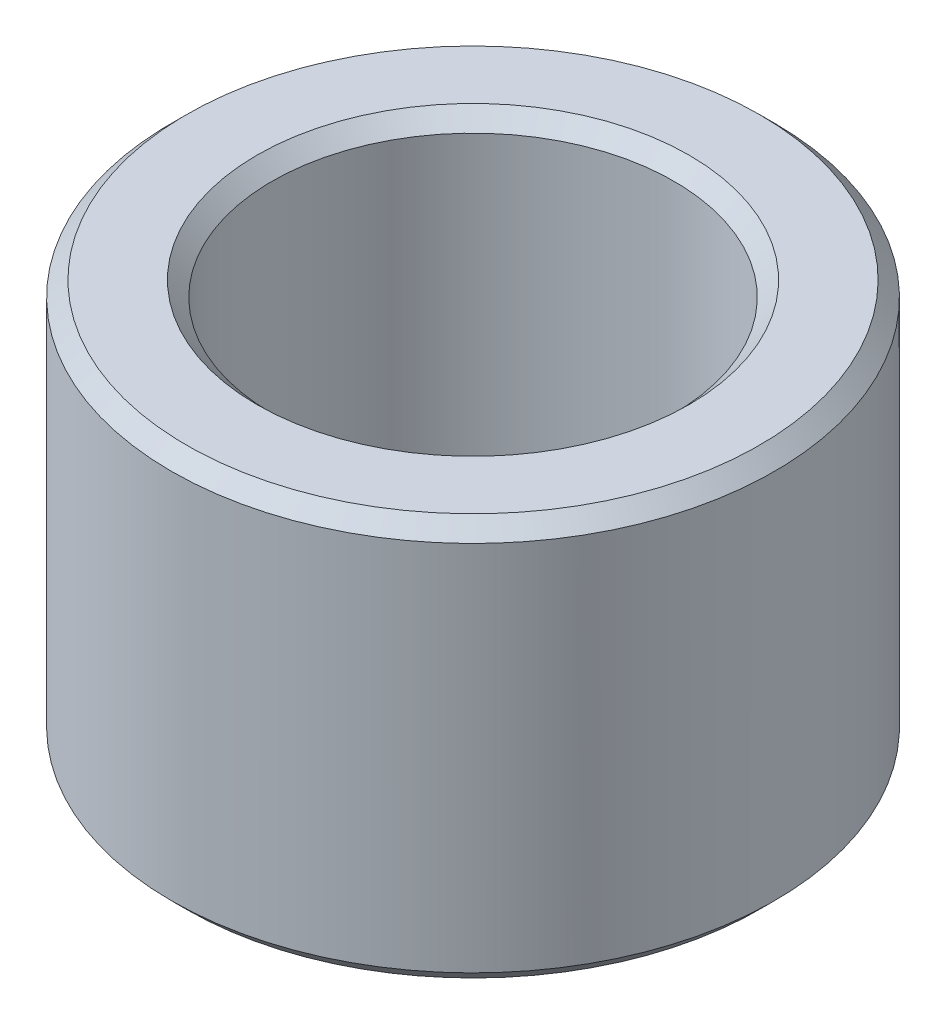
ISO-10303-21;
HEADER;
FILE_DESCRIPTION(('STEP AP214'),'2;1');
FILE_NAME('part.step','',(''),(''),'','','');
FILE_SCHEMA(('AUTOMOTIVE_DESIGN { 1 0 10303 214 1 1 1 1 }'));
ENDSEC;
DATA;
#1=APPLICATION_CONTEXT('core data for automotive mechanical design processes');
#2=APPLICATION_PROTOCOL_DEFINITION('international standard','automotive_design',2000,#1);
#3=PRODUCT_CONTEXT('',#1,'mechanical');
#4=PRODUCT('Part','Part','',(#3));
#5=PRODUCT_RELATED_PRODUCT_CATEGORY('part','',(#4));
#6=PRODUCT_DEFINITION_FORMATION('','',#4);
#7=PRODUCT_DEFINITION_CONTEXT('part definition',#1,'design');
#8=PRODUCT_DEFINITION('design','',#6,#7);
#9=PRODUCT_DEFINITION_SHAPE('','',#8);
#10=(LENGTH_UNIT() NAMED_UNIT(*) SI_UNIT(.MILLI.,.METRE.));
#11=(NAMED_UNIT(*) PLANE_ANGLE_UNIT() SI_UNIT($,.RADIAN.));
#12=(NAMED_UNIT(*) SI_UNIT($,.STERADIAN.) SOLID_ANGLE_UNIT());
#13=UNCERTAINTY_MEASURE_WITH_UNIT(LENGTH_MEASURE(1.E-05),#10,'distance_accuracy_value','');
#14=(GEOMETRIC_REPRESENTATION_CONTEXT(3) GLOBAL_UNCERTAINTY_ASSIGNED_CONTEXT((#13)) GLOBAL_UNIT_ASSIGNED_CONTEXT((#10,
#11,#12)) REPRESENTATION_CONTEXT('',''));
#15=CARTESIAN_POINT('',(0.,0.,0.));
#16=DIRECTION('',(0.,0.,1.));
#17=DIRECTION('',(1.,0.,0.));
#18=AXIS2_PLACEMENT_3D('',#15,#16,#17);
#19=CARTESIAN_POINT('',(6.00000000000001,8.,0.));
#20=DIRECTION('',(0.,-1.,0.));
#21=DIRECTION('',(0.,0.,-1.));
#22=AXIS2_PLACEMENT_3D('',#19,#20,#21);
#23=PLANE('',#22);
#24=CARTESIAN_POINT('',(0.,8.,0.));
#25=DIRECTION('',(0.,-1.,0.));
#26=DIRECTION('',(0.,0.,-1.));
#27=AXIS2_PLACEMENT_3D('',#24,#25,#26);
#28=CIRCLE('',#27,4.30000000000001);
#29=CARTESIAN_POINT('',(0.,8.,4.30000000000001));
#30=VERTEX_POINT('',#29);
#31=EDGE_CURVE('E46',#30,#30,#28,.T.);
#32=ORIENTED_EDGE('',*,*,#31,.T.);
#33=EDGE_LOOP('',(#32));
#34=FACE_BOUND('',#33,.T.);
#35=CARTESIAN_POINT('',(0.,8.,0.));
#36=DIRECTION('',(0.,-1.,0.));
#37=DIRECTION('',(0.,0.,-1.));
#38=AXIS2_PLACEMENT_3D('',#35,#36,#37);
#39=CIRCLE('',#38,5.7);
#40=CARTESIAN_POINT('',(0.,8.,-5.7));
#41=VERTEX_POINT('',#40);
#42=EDGE_CURVE('E49',#41,#41,#39,.F.);
#43=ORIENTED_EDGE('',*,*,#42,.T.);
#44=EDGE_LOOP('',(#43));
#45=FACE_BOUND('',#44,.T.);
#46=ADVANCED_FACE('F27',(#34,#45),#23,.F.);
#47=CARTESIAN_POINT('',(0.,30.,0.));
#48=DIRECTION('',(0.,1.,0.));
#49=DIRECTION('',(0.,0.,1.));
#50=AXIS2_PLACEMENT_3D('',#47,#48,#49);
#51=CYLINDRICAL_SURFACE('',#50,4.00000000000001);
#52=CARTESIAN_POINT('',(0.,7.69999999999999,0.));
#53=DIRECTION('',(0.,-1.,0.));
#54=DIRECTION('',(0.,0.,-1.));
#55=AXIS2_PLACEMENT_3D('',#52,#53,#54);
#56=CIRCLE('',#55,4.00000000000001);
#57=CARTESIAN_POINT('',(0.,7.7,4.00000000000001));
#58=VERTEX_POINT('',#57);
#59=EDGE_CURVE('E52',#58,#58,#56,.F.);
#60=CARTESIAN_POINT('',(0.,0.300000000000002,0.));
#61=DIRECTION('',(0.,1.,0.));
#62=DIRECTION('',(0.,0.,1.));
#63=AXIS2_PLACEMENT_3D('',#60,#61,#62);
#64=CIRCLE('',#63,4.00000000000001);
#65=CARTESIAN_POINT('',(0.,0.300000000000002,4.00000000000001));
#66=VERTEX_POINT('',#65);
#67=EDGE_CURVE('E55',#66,#66,#64,.F.);
#68=CARTESIAN_POINT('',(0.,7.7,4.00000000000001));
#69=CARTESIAN_POINT('',(0.,7.62291666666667,4.00000000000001));
#70=CARTESIAN_POINT('',(0.,7.54583333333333,4.00000000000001));
#71=CARTESIAN_POINT('',(0.,7.39166666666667,4.00000000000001));
#72=CARTESIAN_POINT('',(0.,7.31458333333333,4.00000000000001));
#73=CARTESIAN_POINT('',(0.,7.16041666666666,4.00000000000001));
#74=CARTESIAN_POINT('',(0.,7.08333333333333,4.00000000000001));
#75=CARTESIAN_POINT('',(0.,6.92916666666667,4.00000000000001));
#76=CARTESIAN_POINT('',(0.,6.85208333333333,4.00000000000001));
#77=CARTESIAN_POINT('',(0.,6.69791666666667,4.00000000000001));
#78=CARTESIAN_POINT('',(0.,6.62083333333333,4.00000000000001));
#79=CARTESIAN_POINT('',(0.,6.46666666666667,4.00000000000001));
#80=CARTESIAN_POINT('',(0.,6.38958333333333,4.00000000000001));
#81=CARTESIAN_POINT('',(0.,6.23541666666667,4.00000000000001));
#82=CARTESIAN_POINT('',(0.,6.15833333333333,4.00000000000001));
#83=CARTESIAN_POINT('',(0.,6.00416666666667,4.00000000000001));
#84=CARTESIAN_POINT('',(0.,5.92708333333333,4.00000000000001));
#85=CARTESIAN_POINT('',(0.,5.77291666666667,4.00000000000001));
#86=CARTESIAN_POINT('',(0.,5.69583333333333,4.00000000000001));
#87=CARTESIAN_POINT('',(0.,5.54166666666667,4.00000000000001));
#88=CARTESIAN_POINT('',(0.,5.46458333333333,4.00000000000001));
#89=CARTESIAN_POINT('',(0.,5.31041666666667,4.00000000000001));
#90=CARTESIAN_POINT('',(0.,5.23333333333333,4.00000000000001));
#91=CARTESIAN_POINT('',(0.,5.07916666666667,4.00000000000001));
#92=CARTESIAN_POINT('',(0.,5.00208333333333,4.00000000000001));
#93=CARTESIAN_POINT('',(0.,4.84791666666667,4.00000000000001));
#94=CARTESIAN_POINT('',(0.,4.77083333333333,4.00000000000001));
#95=CARTESIAN_POINT('',(0.,4.61666666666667,4.00000000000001));
#96=CARTESIAN_POINT('',(0.,4.53958333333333,4.00000000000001));
#97=CARTESIAN_POINT('',(0.,4.38541666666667,4.00000000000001));
#98=CARTESIAN_POINT('',(0.,4.30833333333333,4.00000000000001));
#99=CARTESIAN_POINT('',(0.,4.15416666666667,4.00000000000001));
#100=CARTESIAN_POINT('',(0.,4.07708333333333,4.00000000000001));
#101=CARTESIAN_POINT('',(0.,3.92291666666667,4.00000000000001));
#102=CARTESIAN_POINT('',(0.,3.84583333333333,4.00000000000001));
#103=CARTESIAN_POINT('',(0.,3.69166666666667,4.00000000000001));
#104=CARTESIAN_POINT('',(0.,3.61458333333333,4.00000000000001));
#105=CARTESIAN_POINT('',(0.,3.46041666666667,4.00000000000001));
#106=CARTESIAN_POINT('',(0.,3.38333333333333,4.00000000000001));
#107=CARTESIAN_POINT('',(0.,3.22916666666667,4.00000000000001));
#108=CARTESIAN_POINT('',(0.,3.15208333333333,4.00000000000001));
#109=CARTESIAN_POINT('',(0.,2.99791666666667,4.00000000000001));
#110=CARTESIAN_POINT('',(0.,2.92083333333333,4.00000000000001));
#111=CARTESIAN_POINT('',(0.,2.76666666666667,4.00000000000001));
#112=CARTESIAN_POINT('',(0.,2.68958333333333,4.00000000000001));
#113=CARTESIAN_POINT('',(0.,2.53541666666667,4.00000000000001));
#114=CARTESIAN_POINT('',(0.,2.45833333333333,4.00000000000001));
#115=CARTESIAN_POINT('',(0.,2.30416666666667,4.00000000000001));
#116=CARTESIAN_POINT('',(0.,2.22708333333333,4.00000000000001));
#117=CARTESIAN_POINT('',(0.,2.07291666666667,4.00000000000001));
#118=CARTESIAN_POINT('',(0.,1.99583333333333,4.00000000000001));
#119=CARTESIAN_POINT('',(0.,1.84166666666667,4.00000000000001));
#120=CARTESIAN_POINT('',(0.,1.76458333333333,4.00000000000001));
#121=CARTESIAN_POINT('',(0.,1.61041666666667,4.00000000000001));
#122=CARTESIAN_POINT('',(0.,1.53333333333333,4.00000000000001));
#123=CARTESIAN_POINT('',(0.,1.37916666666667,4.00000000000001));
#124=CARTESIAN_POINT('',(0.,1.30208333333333,4.00000000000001));
#125=CARTESIAN_POINT('',(0.,1.14791666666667,4.00000000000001));
#126=CARTESIAN_POINT('',(0.,1.07083333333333,4.00000000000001));
#127=CARTESIAN_POINT('',(0.,0.916666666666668,4.00000000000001));
#128=CARTESIAN_POINT('',(0.,0.839583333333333,4.00000000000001));
#129=CARTESIAN_POINT('',(0.,0.685416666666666,4.00000000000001));
#130=CARTESIAN_POINT('',(0.,0.608333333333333,4.00000000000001));
#131=CARTESIAN_POINT('',(0.,0.454166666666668,4.00000000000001));
#132=CARTESIAN_POINT('',(0.,0.377083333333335,4.00000000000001));
#133=CARTESIAN_POINT('',(0.,0.300000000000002,4.00000000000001));
#134=B_SPLINE_CURVE_WITH_KNOTS('',3,(#68,#69,#70,#71,#72,#73,#74,#75,#76,#77,#78,#79,#80,#81,
#82,#83,#84,#85,#86,#87,#88,#89,#90,#91,#92,#93,#94,#95,#96,#97,#98,#99,#100,#101,#102,#103,
#104,#105,#106,#107,#108,#109,#110,#111,#112,#113,#114,#115,#116,#117,#118,#119,#120,#121,#122,
#123,#124,#125,#126,#127,#128,#129,#130,#131,#132,#133),.UNSPECIFIED.,.F.,.F.,(4,2,2,2,2,2,2,2,
2,2,2,2,2,2,2,2,2,2,2,2,2,2,2,2,2,2,2,2,2,2,2,2,4),(0.,0.231249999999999,0.462500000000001,
0.69375,0.924999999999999,1.15625,1.3875,1.61875,1.85,2.08125,2.3125,2.54375,2.775,3.00625,
3.2375,3.46875,3.7,3.93125,4.1625,4.39375,4.625,4.85625,5.0875,5.31875,5.55,5.78125,6.0125,
6.24375,6.475,6.70625,6.9375,7.16875,7.4),.UNSPECIFIED.);
#135=EDGE_CURVE('BSEAM59',#58,#66,#134,.T.);
#136=ORIENTED_EDGE('',*,*,#59,.T.);
#137=ORIENTED_EDGE('',*,*,#67,.T.);
#138=ORIENTED_EDGE('',*,*,#135,.T.);
#139=ORIENTED_EDGE('',*,*,#135,.F.);
#140=EDGE_LOOP('',(#136,#138,#137,#139));
#141=FACE_BOUND('',#140,.T.);
#142=ADVANCED_FACE('F59',(#141),#51,.F.);
#143=CARTESIAN_POINT('',(4.,0.,0.));
#144=DIRECTION('',(0.,1.,0.));
#145=DIRECTION('',(0.,0.,1.));
#146=AXIS2_PLACEMENT_3D('',#143,#144,#145);
#147=PLANE('',#146);
#148=CARTESIAN_POINT('',(0.,0.,0.));
#149=DIRECTION('',(0.,1.,0.));
#150=DIRECTION('',(0.,0.,1.));
#151=AXIS2_PLACEMENT_3D('',#148,#149,#150);
#152=CIRCLE('',#151,5.70000000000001);
#153=CARTESIAN_POINT('',(0.,0.,5.7));
#154=VERTEX_POINT('',#153);
#155=EDGE_CURVE('E10',#154,#154,#152,.F.);
#156=ORIENTED_EDGE('',*,*,#155,.T.);
#157=EDGE_LOOP('',(#156));
#158=FACE_BOUND('',#157,.T.);
#159=CARTESIAN_POINT('',(0.,0.,0.));
#160=DIRECTION('',(0.,1.,0.));
#161=DIRECTION('',(0.,0.,1.));
#162=AXIS2_PLACEMENT_3D('',#159,#160,#161);
#163=CIRCLE('',#162,4.30000000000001);
#164=CARTESIAN_POINT('',(0.,0.,4.30000000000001));
#165=VERTEX_POINT('',#164);
#166=EDGE_CURVE('E33',#165,#165,#163,.T.);
#167=ORIENTED_EDGE('',*,*,#166,.T.);
#168=EDGE_LOOP('',(#167));
#169=FACE_BOUND('',#168,.T.);
#170=ADVANCED_FACE('F77',(#158,#169),#147,.F.);
#171=CARTESIAN_POINT('',(0.,30.,0.));
#172=DIRECTION('',(0.,1.,0.));
#173=DIRECTION('',(0.,0.,1.));
#174=AXIS2_PLACEMENT_3D('',#171,#172,#173);
#175=CYLINDRICAL_SURFACE('',#174,6.00000000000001);
#176=CARTESIAN_POINT('',(0.,7.7,0.));
#177=DIRECTION('',(0.,-1.,0.));
#178=DIRECTION('',(0.,0.,-1.));
#179=AXIS2_PLACEMENT_3D('',#176,#177,#178);
#180=CIRCLE('',#179,6.00000000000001);
#181=CARTESIAN_POINT('',(0.,7.7,-6.00000000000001));
#182=VERTEX_POINT('',#181);
#183=EDGE_CURVE('E37',#182,#182,#180,.T.);
#184=ORIENTED_EDGE('',*,*,#183,.T.);
#185=EDGE_LOOP('',(#184));
#186=FACE_BOUND('',#185,.T.);
#187=CARTESIAN_POINT('',(0.,0.300000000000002,0.));
#188=DIRECTION('',(0.,1.,0.));
#189=DIRECTION('',(0.,0.,1.));
#190=AXIS2_PLACEMENT_3D('',#187,#188,#189);
#191=CIRCLE('',#190,6.00000000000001);
#192=CARTESIAN_POINT('',(0.,0.300000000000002,6.00000000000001));
#193=VERTEX_POINT('',#192);
#194=EDGE_CURVE('E41',#193,#193,#191,.T.);
#195=ORIENTED_EDGE('',*,*,#194,.T.);
#196=EDGE_LOOP('',(#195));
#197=FACE_BOUND('',#196,.T.);
#198=ADVANCED_FACE('F90',(#186,#197),#175,.T.);
#199=CARTESIAN_POINT('',(0.,7.69999999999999,0.));
#200=DIRECTION('',(0.,1.,0.));
#201=DIRECTION('',(0.,0.,1.));
#202=AXIS2_PLACEMENT_3D('',#199,#200,#201);
#203=CONICAL_SURFACE('',#202,4.00000000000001,0.785398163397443);
#204=CARTESIAN_POINT('',(0.,8.,4.30000000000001));
#205=CARTESIAN_POINT('',(0.,7.996875,4.29687500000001));
#206=CARTESIAN_POINT('',(0.,7.99375,4.29375000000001));
#207=CARTESIAN_POINT('',(0.,7.9875,4.28750000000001));
#208=CARTESIAN_POINT('',(0.,7.984375,4.28437500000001));
#209=CARTESIAN_POINT('',(0.,7.978125,4.27812500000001));
#210=CARTESIAN_POINT('',(0.,7.975,4.27500000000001));
#211=CARTESIAN_POINT('',(0.,7.96875,4.26875000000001));
#212=CARTESIAN_POINT('',(0.,7.965625,4.26562500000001));
#213=CARTESIAN_POINT('',(0.,7.959375,4.25937500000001));
#214=CARTESIAN_POINT('',(0.,7.95625,4.25625000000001));
#215=CARTESIAN_POINT('',(0.,7.95,4.25000000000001));
#216=CARTESIAN_POINT('',(0.,7.946875,4.24687500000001));
#217=CARTESIAN_POINT('',(0.,7.940625,4.24062500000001));
#218=CARTESIAN_POINT('',(0.,7.9375,4.23750000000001));
#219=CARTESIAN_POINT('',(0.,7.93125,4.23125000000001));
#220=CARTESIAN_POINT('',(0.,7.928125,4.22812500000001));
#221=CARTESIAN_POINT('',(0.,7.921875,4.22187500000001));
#222=CARTESIAN_POINT('',(0.,7.91875,4.21875000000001));
#223=CARTESIAN_POINT('',(0.,7.9125,4.21250000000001));
#224=CARTESIAN_POINT('',(0.,7.909375,4.20937500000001));
#225=CARTESIAN_POINT('',(0.,7.903125,4.20312500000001));
#226=CARTESIAN_POINT('',(0.,7.9,4.20000000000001));
#227=CARTESIAN_POINT('',(0.,7.89375,4.19375000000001));
#228=CARTESIAN_POINT('',(0.,7.890625,4.19062500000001));
#229=CARTESIAN_POINT('',(0.,7.884375,4.18437500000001));
#230=CARTESIAN_POINT('',(0.,7.88125,4.18125000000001));
#231=CARTESIAN_POINT('',(0.,7.875,4.17500000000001));
#232=CARTESIAN_POINT('',(0.,7.871875,4.17187500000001));
#233=CARTESIAN_POINT('',(0.,7.865625,4.16562500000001));
#234=CARTESIAN_POINT('',(0.,7.8625,4.16250000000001));
#235=CARTESIAN_POINT('',(0.,7.85625,4.15625000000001));
#236=CARTESIAN_POINT('',(0.,7.853125,4.15312500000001));
#237=CARTESIAN_POINT('',(0.,7.846875,4.14687500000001));
#238=CARTESIAN_POINT('',(0.,7.84375,4.14375000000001));
#239=CARTESIAN_POINT('',(0.,7.8375,4.13750000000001));
#240=CARTESIAN_POINT('',(0.,7.834375,4.13437500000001));
#241=CARTESIAN_POINT('',(0.,7.828125,4.12812500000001));
#242=CARTESIAN_POINT('',(0.,7.825,4.12500000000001));
#243=CARTESIAN_POINT('',(0.,7.81875,4.11875000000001));
#244=CARTESIAN_POINT('',(0.,7.815625,4.11562500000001));
#245=CARTESIAN_POINT('',(0.,7.809375,4.10937500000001));
#246=CARTESIAN_POINT('',(0.,7.80625,4.10625000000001));
#247=CARTESIAN_POINT('',(0.,7.8,4.10000000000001));
#248=CARTESIAN_POINT('',(0.,7.796875,4.09687500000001));
#249=CARTESIAN_POINT('',(0.,7.790625,4.09062500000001));
#250=CARTESIAN_POINT('',(0.,7.7875,4.08750000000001));
#251=CARTESIAN_POINT('',(0.,7.78125,4.08125000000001));
#252=CARTESIAN_POINT('',(0.,7.778125,4.07812500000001));
#253=CARTESIAN_POINT('',(0.,7.771875,4.07187500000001));
#254=CARTESIAN_POINT('',(0.,7.76875,4.06875000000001));
#255=CARTESIAN_POINT('',(0.,7.7625,4.06250000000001));
#256=CARTESIAN_POINT('',(0.,7.759375,4.05937500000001));
#257=CARTESIAN_POINT('',(0.,7.753125,4.05312500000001));
#258=CARTESIAN_POINT('',(0.,7.75,4.05000000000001));
#259=CARTESIAN_POINT('',(0.,7.74375,4.04375000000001));
#260=CARTESIAN_POINT('',(0.,7.740625,4.04062500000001));
#261=CARTESIAN_POINT('',(0.,7.734375,4.03437500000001));
#262=CARTESIAN_POINT('',(0.,7.73125,4.03125000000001));
#263=CARTESIAN_POINT('',(0.,7.725,4.02500000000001));
#264=CARTESIAN_POINT('',(0.,7.721875,4.02187500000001));
#265=CARTESIAN_POINT('',(0.,7.715625,4.01562500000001));
#266=CARTESIAN_POINT('',(0.,7.7125,4.01250000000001));
#267=CARTESIAN_POINT('',(0.,7.70625,4.00625000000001));
#268=CARTESIAN_POINT('',(0.,7.703125,4.00312500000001));
#269=CARTESIAN_POINT('',(0.,7.69999999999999,4.00000000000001));
#270=B_SPLINE_CURVE_WITH_KNOTS('',3,(#204,#205,#206,#207,#208,#209,#210,#211,#212,#213,#214,
#215,#216,#217,#218,#219,#220,#221,#222,#223,#224,#225,#226,#227,#228,#229,#230,#231,#232,#233,
#234,#235,#236,#237,#238,#239,#240,#241,#242,#243,#244,#245,#246,#247,#248,#249,#250,#251,#252,
#253,#254,#255,#256,#257,#258,#259,#260,#261,#262,#263,#264,#265,#266,#267,#268,#269),
.UNSPECIFIED.,.F.,.F.,(4,2,2,2,2,2,2,2,2,2,2,2,2,2,2,2,2,2,2,2,2,2,2,2,2,2,2,2,2,2,2,2,4),(0.,
0.0132582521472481,0.0265165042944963,0.0397747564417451,0.053033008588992,0.0662912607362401,
0.0795495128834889,0.0928077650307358,0.106066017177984,0.119324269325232,0.13258252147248,
0.145840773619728,0.159099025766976,0.172357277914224,0.185615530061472,0.19887378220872,
0.212132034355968,0.225390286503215,0.238648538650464,0.251906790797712,0.265165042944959,
0.278423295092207,0.291681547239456,0.304939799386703,0.318198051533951,0.331456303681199,
0.344714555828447,0.357972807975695,0.371231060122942,0.384489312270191,0.397747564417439,
0.411005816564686,0.424264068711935),.UNSPECIFIED.);
#271=EDGE_CURVE('BSEAM84',#30,#58,#270,.T.);
#272=ORIENTED_EDGE('',*,*,#31,.F.);
#273=ORIENTED_EDGE('',*,*,#59,.F.);
#274=ORIENTED_EDGE('',*,*,#271,.T.);
#275=ORIENTED_EDGE('',*,*,#271,.F.);
#276=EDGE_LOOP('',(#272,#274,#273,#275));
#277=FACE_BOUND('',#276,.T.);
#278=ADVANCED_FACE('F84',(#277),#203,.F.);
#279=CARTESIAN_POINT('',(0.,8.,0.));
#280=DIRECTION('',(0.,-1.,0.));
#281=DIRECTION('',(0.,0.,-1.));
#282=AXIS2_PLACEMENT_3D('',#279,#280,#281);
#283=CONICAL_SURFACE('',#282,5.7,0.785398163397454);
#284=ORIENTED_EDGE('',*,*,#183,.F.);
#285=EDGE_LOOP('',(#284));
#286=FACE_BOUND('',#285,.T.);
#287=ORIENTED_EDGE('',*,*,#42,.F.);
#288=EDGE_LOOP('',(#287));
#289=FACE_BOUND('',#288,.T.);
#290=ADVANCED_FACE('F69',(#286,#289),#283,.T.);
#291=CARTESIAN_POINT('',(0.,0.300000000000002,0.));
#292=DIRECTION('',(0.,1.,0.));
#293=DIRECTION('',(0.,0.,1.));
#294=AXIS2_PLACEMENT_3D('',#291,#292,#293);
#295=CONICAL_SURFACE('',#294,6.00000000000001,0.785398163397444);
#296=CARTESIAN_POINT('',(0.,0.,5.7));
#297=CARTESIAN_POINT('',(0.,0.00312499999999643,5.703125));
#298=CARTESIAN_POINT('',(0.,0.00624999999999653,5.70625));
#299=CARTESIAN_POINT('',(0.,0.0124999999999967,5.7125));
#300=CARTESIAN_POINT('',(0.,0.0156249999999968,5.715625));
#301=CARTESIAN_POINT('',(0.,0.0218749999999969,5.721875));
#302=CARTESIAN_POINT('',(0.,0.0249999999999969,5.725));
#303=CARTESIAN_POINT('',(0.,0.0312499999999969,5.73125));
#304=CARTESIAN_POINT('',(0.,0.034374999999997,5.734375));
#305=CARTESIAN_POINT('',(0.,0.0406249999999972,5.740625));
#306=CARTESIAN_POINT('',(0.,0.0437499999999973,5.74375));
#307=CARTESIAN_POINT('',(0.,0.0499999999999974,5.75));
#308=CARTESIAN_POINT('',(0.,0.0531249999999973,5.753125));
#309=CARTESIAN_POINT('',(0.,0.0593749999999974,5.759375));
#310=CARTESIAN_POINT('',(0.,0.0624999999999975,5.7625));
#311=CARTESIAN_POINT('',(0.,0.0687499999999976,5.76875));
#312=CARTESIAN_POINT('',(0.,0.0718749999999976,5.771875));
#313=CARTESIAN_POINT('',(0.,0.0781249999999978,5.778125));
#314=CARTESIAN_POINT('',(0.,0.0812499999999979,5.78125));
#315=CARTESIAN_POINT('',(0.,0.087499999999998,5.7875));
#316=CARTESIAN_POINT('',(0.,0.0906249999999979,5.790625));
#317=CARTESIAN_POINT('',(0.,0.096874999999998,5.796875));
#318=CARTESIAN_POINT('',(0.,0.0999999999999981,5.80000000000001));
#319=CARTESIAN_POINT('',(0.,0.106249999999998,5.80625));
#320=CARTESIAN_POINT('',(0.,0.109374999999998,5.809375));
#321=CARTESIAN_POINT('',(0.,0.115624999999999,5.81562500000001));
#322=CARTESIAN_POINT('',(0.,0.118749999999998,5.81875));
#323=CARTESIAN_POINT('',(0.,0.124999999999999,5.825));
#324=CARTESIAN_POINT('',(0.,0.128124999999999,5.82812500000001));
#325=CARTESIAN_POINT('',(0.,0.134374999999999,5.834375));
#326=CARTESIAN_POINT('',(0.,0.137499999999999,5.8375));
#327=CARTESIAN_POINT('',(0.,0.143749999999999,5.84375));
#328=CARTESIAN_POINT('',(0.,0.146874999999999,5.84687500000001));
#329=CARTESIAN_POINT('',(0.,0.153124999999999,5.853125));
#330=CARTESIAN_POINT('',(0.,0.156249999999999,5.85625));
#331=CARTESIAN_POINT('',(0.,0.162499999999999,5.86250000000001));
#332=CARTESIAN_POINT('',(0.,0.165624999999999,5.865625));
#333=CARTESIAN_POINT('',(0.,0.171874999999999,5.871875));
#334=CARTESIAN_POINT('',(0.,0.175,5.87500000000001));
#335=CARTESIAN_POINT('',(0.,0.18125,5.88125));
#336=CARTESIAN_POINT('',(0.,0.184375,5.884375));
#337=CARTESIAN_POINT('',(0.,0.190625,5.89062500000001));
#338=CARTESIAN_POINT('',(0.,0.19375,5.89375000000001));
#339=CARTESIAN_POINT('',(0.,0.2,5.9));
#340=CARTESIAN_POINT('',(0.,0.203125,5.90312500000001));
#341=CARTESIAN_POINT('',(0.,0.209375,5.90937500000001));
#342=CARTESIAN_POINT('',(0.,0.2125,5.91250000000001));
#343=CARTESIAN_POINT('',(0.,0.21875,5.91875000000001));
#344=CARTESIAN_POINT('',(0.,0.221875,5.92187500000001));
#345=CARTESIAN_POINT('',(0.,0.228125,5.92812500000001));
#346=CARTESIAN_POINT('',(0.,0.23125,5.93125000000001));
#347=CARTESIAN_POINT('',(0.,0.237500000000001,5.93750000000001));
#348=CARTESIAN_POINT('',(0.,0.240625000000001,5.94062500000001));
#349=CARTESIAN_POINT('',(0.,0.246875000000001,5.94687500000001));
#350=CARTESIAN_POINT('',(0.,0.250000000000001,5.95000000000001));
#351=CARTESIAN_POINT('',(0.,0.256250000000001,5.95625000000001));
#352=CARTESIAN_POINT('',(0.,0.259375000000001,5.95937500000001));
#353=CARTESIAN_POINT('',(0.,0.265625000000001,5.96562500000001));
#354=CARTESIAN_POINT('',(0.,0.268750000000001,5.96875000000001));
#355=CARTESIAN_POINT('',(0.,0.275000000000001,5.97500000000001));
#356=CARTESIAN_POINT('',(0.,0.278125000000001,5.97812500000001));
#357=CARTESIAN_POINT('',(0.,0.284375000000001,5.98437500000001));
#358=CARTESIAN_POINT('',(0.,0.287500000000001,5.98750000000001));
#359=CARTESIAN_POINT('',(0.,0.293750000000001,5.99375000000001));
#360=CARTESIAN_POINT('',(0.,0.296875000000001,5.99687500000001));
#361=CARTESIAN_POINT('',(0.,0.300000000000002,6.00000000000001));
#362=B_SPLINE_CURVE_WITH_KNOTS('',3,(#296,#297,#298,#299,#300,#301,#302,#303,#304,#305,#306,
#307,#308,#309,#310,#311,#312,#313,#314,#315,#316,#317,#318,#319,#320,#321,#322,#323,#324,#325,
#326,#327,#328,#329,#330,#331,#332,#333,#334,#335,#336,#337,#338,#339,#340,#341,#342,#343,#344,
#345,#346,#347,#348,#349,#350,#351,#352,#353,#354,#355,#356,#357,#358,#359,#360,#361),
.UNSPECIFIED.,.F.,.F.,(4,2,2,2,2,2,2,2,2,2,2,2,2,2,2,2,2,2,2,2,2,2,2,2,2,2,2,2,2,2,2,2,4),(0.,
0.0132582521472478,0.0265165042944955,0.0397747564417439,0.0530330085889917,0.0662912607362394,
0.0795495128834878,0.0928077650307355,0.106066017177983,0.119324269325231,0.132582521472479,
0.145840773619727,0.159099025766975,0.172357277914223,0.185615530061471,0.198873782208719,
0.212132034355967,0.225390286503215,0.238648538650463,0.251906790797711,0.265165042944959,
0.278423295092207,0.291681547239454,0.304939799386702,0.318198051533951,0.331456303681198,
0.344714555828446,0.357972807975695,0.371231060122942,0.38448931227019,0.397747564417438,
0.411005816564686,0.424264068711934),.UNSPECIFIED.);
#363=EDGE_CURVE('BSEAM64',#154,#193,#362,.T.);
#364=ORIENTED_EDGE('',*,*,#155,.F.);
#365=ORIENTED_EDGE('',*,*,#194,.F.);
#366=ORIENTED_EDGE('',*,*,#363,.T.);
#367=ORIENTED_EDGE('',*,*,#363,.F.);
#368=EDGE_LOOP('',(#364,#366,#365,#367));
#369=FACE_BOUND('',#368,.T.);
#370=ADVANCED_FACE('F64',(#369),#295,.T.);
#371=CARTESIAN_POINT('',(0.,0.,0.));
#372=DIRECTION('',(0.,-1.,0.));
#373=DIRECTION('',(0.,0.,-1.));
#374=AXIS2_PLACEMENT_3D('',#371,#372,#373);
#375=CONICAL_SURFACE('',#374,4.30000000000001,0.785398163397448);
#376=ORIENTED_EDGE('',*,*,#67,.F.);
#377=EDGE_LOOP('',(#376));
#378=FACE_BOUND('',#377,.T.);
#379=ORIENTED_EDGE('',*,*,#166,.F.);
#380=EDGE_LOOP('',(#379));
#381=FACE_BOUND('',#380,.T.);
#382=ADVANCED_FACE('F61',(#378,#381),#375,.F.);
#383=CLOSED_SHELL('',(#46,#142,#170,#198,#278,#290,#370,#382));
#384=MANIFOLD_SOLID_BREP('B2',#383);
#385=ADVANCED_BREP_SHAPE_REPRESENTATION('',(#18,#384),#14);
#386=SHAPE_DEFINITION_REPRESENTATION(#9,#385);
ENDSEC;
END-ISO-10303-21;
